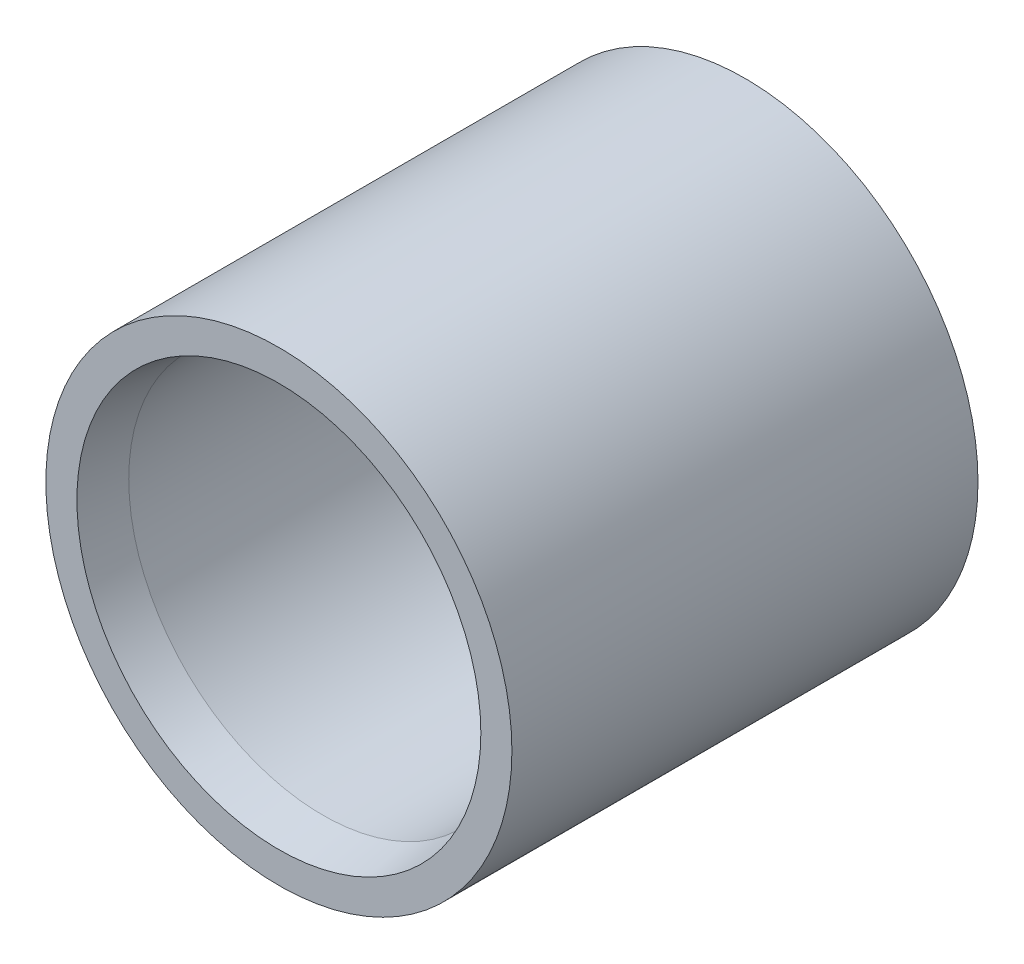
ISO-10303-21;
HEADER;
FILE_DESCRIPTION(('STEP AP214'),'2;1');
FILE_NAME('part.step','',(''),(''),'','','');
FILE_SCHEMA(('AUTOMOTIVE_DESIGN { 1 0 10303 214 1 1 1 1 }'));
ENDSEC;
DATA;
#1=APPLICATION_CONTEXT('core data for automotive mechanical design processes');
#2=APPLICATION_PROTOCOL_DEFINITION('international standard','automotive_design',2000,#1);
#3=PRODUCT_CONTEXT('',#1,'mechanical');
#4=PRODUCT('Part','Part','',(#3));
#5=PRODUCT_RELATED_PRODUCT_CATEGORY('part','',(#4));
#6=PRODUCT_DEFINITION_FORMATION('','',#4);
#7=PRODUCT_DEFINITION_CONTEXT('part definition',#1,'design');
#8=PRODUCT_DEFINITION('design','',#6,#7);
#9=PRODUCT_DEFINITION_SHAPE('','',#8);
#10=(LENGTH_UNIT() NAMED_UNIT(*) SI_UNIT(.MILLI.,.METRE.));
#11=(NAMED_UNIT(*) PLANE_ANGLE_UNIT() SI_UNIT($,.RADIAN.));
#12=(NAMED_UNIT(*) SI_UNIT($,.STERADIAN.) SOLID_ANGLE_UNIT());
#13=UNCERTAINTY_MEASURE_WITH_UNIT(LENGTH_MEASURE(1.E-05),#10,'distance_accuracy_value','');
#14=(GEOMETRIC_REPRESENTATION_CONTEXT(3) GLOBAL_UNCERTAINTY_ASSIGNED_CONTEXT((#13)) GLOBAL_UNIT_ASSIGNED_CONTEXT((#10,
#11,#12)) REPRESENTATION_CONTEXT('',''));
#15=CARTESIAN_POINT('',(0.,0.,0.));
#16=DIRECTION('',(0.,0.,1.));
#17=DIRECTION('',(1.,0.,0.));
#18=AXIS2_PLACEMENT_3D('',#15,#16,#17);
#19=CARTESIAN_POINT('',(-15.,28.,-28.9705627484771));
#20=DIRECTION('',(0.,0.,1.));
#21=DIRECTION('',(1.,0.,0.));
#22=AXIS2_PLACEMENT_3D('',#19,#20,#21);
#23=CYLINDRICAL_SURFACE('',#22,6.);
#24=CARTESIAN_POINT('',(-15.,28.,-12.));
#25=DIRECTION('',(0.,0.,1.));
#26=DIRECTION('',(1.,0.,0.));
#27=AXIS2_PLACEMENT_3D('',#24,#25,#26);
#28=CIRCLE('',#27,6.);
#29=CARTESIAN_POINT('',(-9.,28.,-12.));
#30=VERTEX_POINT('',#29);
#31=EDGE_CURVE('E48',#30,#30,#28,.F.);
#32=ORIENTED_EDGE('',*,*,#31,.F.);
#33=EDGE_LOOP('',(#32));
#34=FACE_BOUND('',#33,.T.);
#35=CARTESIAN_POINT('',(-15.,28.,0.));
#36=DIRECTION('',(0.,0.,1.));
#37=DIRECTION('',(1.,0.,0.));
#38=AXIS2_PLACEMENT_3D('',#35,#36,#37);
#39=CIRCLE('',#38,6.);
#40=CARTESIAN_POINT('',(-9.,28.,0.));
#41=VERTEX_POINT('',#40);
#42=EDGE_CURVE('E49',#41,#41,#39,.T.);
#43=ORIENTED_EDGE('',*,*,#42,.F.);
#44=EDGE_LOOP('',(#43));
#45=FACE_BOUND('',#44,.T.);
#46=ADVANCED_FACE('F29',(#34,#45),#23,.T.);
#47=CARTESIAN_POINT('',(-15.,28.,0.));
#48=DIRECTION('',(0.,0.,1.));
#49=DIRECTION('',(1.,0.,0.));
#50=AXIS2_PLACEMENT_3D('',#47,#48,#49);
#51=PLANE('',#50);
#52=CARTESIAN_POINT('',(-15.,28.,0.));
#53=DIRECTION('',(0.,0.,1.));
#54=DIRECTION('',(1.,0.,0.));
#55=AXIS2_PLACEMENT_3D('',#52,#53,#54);
#56=CIRCLE('',#55,5.19999999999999);
#57=CARTESIAN_POINT('',(-9.80000000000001,28.,0.));
#58=VERTEX_POINT('',#57);
#59=EDGE_CURVE('E35',#58,#58,#56,.F.);
#60=ORIENTED_EDGE('',*,*,#59,.T.);
#61=EDGE_LOOP('',(#60));
#62=FACE_BOUND('',#61,.T.);
#63=ORIENTED_EDGE('',*,*,#42,.T.);
#64=EDGE_LOOP('',(#63));
#65=FACE_BOUND('',#64,.T.);
#66=ADVANCED_FACE('F59',(#62,#65),#51,.T.);
#67=CARTESIAN_POINT('',(-15.,28.,-28.9705627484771));
#68=DIRECTION('',(0.,0.,1.));
#69=DIRECTION('',(1.,0.,0.));
#70=AXIS2_PLACEMENT_3D('',#67,#68,#69);
#71=CYLINDRICAL_SURFACE('',#70,5.);
#72=CARTESIAN_POINT('',(-15.,28.,-1.13425636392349));
#73=DIRECTION('',(0.,0.,1.));
#74=DIRECTION('',(1.,0.,0.));
#75=AXIS2_PLACEMENT_3D('',#72,#73,#74);
#76=CIRCLE('',#75,5.);
#77=CARTESIAN_POINT('',(-10.,28.,-1.13425636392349));
#78=VERTEX_POINT('',#77);
#79=EDGE_CURVE('E39',#78,#78,#76,.T.);
#80=ORIENTED_EDGE('',*,*,#79,.T.);
#81=EDGE_LOOP('',(#80));
#82=FACE_BOUND('',#81,.T.);
#83=CARTESIAN_POINT('',(-15.,28.,-10.8657436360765));
#84=DIRECTION('',(0.,0.,1.));
#85=DIRECTION('',(1.,0.,0.));
#86=AXIS2_PLACEMENT_3D('',#83,#84,#85);
#87=CIRCLE('',#86,5.);
#88=CARTESIAN_POINT('',(-10.,28.,-10.8657436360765));
#89=VERTEX_POINT('',#88);
#90=EDGE_CURVE('E43',#89,#89,#87,.F.);
#91=ORIENTED_EDGE('',*,*,#90,.T.);
#92=EDGE_LOOP('',(#91));
#93=FACE_BOUND('',#92,.T.);
#94=ADVANCED_FACE('F63',(#82,#93),#71,.F.);
#95=CARTESIAN_POINT('',(-7.,13.,-12.));
#96=DIRECTION('',(0.,0.,1.));
#97=DIRECTION('',(1.,0.,0.));
#98=AXIS2_PLACEMENT_3D('',#95,#96,#97);
#99=PLANE('',#98);
#100=CARTESIAN_POINT('',(-15.,28.,-12.));
#101=DIRECTION('',(0.,0.,1.));
#102=DIRECTION('',(1.,0.,0.));
#103=AXIS2_PLACEMENT_3D('',#100,#101,#102);
#104=CIRCLE('',#103,5.2);
#105=CARTESIAN_POINT('',(-9.8,28.,-12.));
#106=VERTEX_POINT('',#105);
#107=EDGE_CURVE('E10',#106,#106,#104,.T.);
#108=ORIENTED_EDGE('',*,*,#107,.T.);
#109=EDGE_LOOP('',(#108));
#110=FACE_BOUND('',#109,.T.);
#111=ORIENTED_EDGE('',*,*,#31,.T.);
#112=EDGE_LOOP('',(#111));
#113=FACE_BOUND('',#112,.T.);
#114=ADVANCED_FACE('F55',(#110,#113),#99,.F.);
#115=CARTESIAN_POINT('',(-15.,28.,-1.13425636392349));
#116=DIRECTION('',(0.,0.,1.));
#117=DIRECTION('',(1.,0.,0.));
#118=AXIS2_PLACEMENT_3D('',#115,#116,#117);
#119=CONICAL_SURFACE('',#118,5.,0.174532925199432);
#120=ORIENTED_EDGE('',*,*,#59,.F.);
#121=EDGE_LOOP('',(#120));
#122=FACE_BOUND('',#121,.T.);
#123=ORIENTED_EDGE('',*,*,#79,.F.);
#124=EDGE_LOOP('',(#123));
#125=FACE_BOUND('',#124,.T.);
#126=ADVANCED_FACE('F72',(#122,#125),#119,.F.);
#127=CARTESIAN_POINT('',(-15.,28.,-10.8657436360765));
#128=DIRECTION('',(0.,0.,-1.));
#129=DIRECTION('',(-1.,0.,0.));
#130=AXIS2_PLACEMENT_3D('',#127,#128,#129);
#131=CONICAL_SURFACE('',#130,5.,0.174532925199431);
#132=ORIENTED_EDGE('',*,*,#107,.F.);
#133=EDGE_LOOP('',(#132));
#134=FACE_BOUND('',#133,.T.);
#135=ORIENTED_EDGE('',*,*,#90,.F.);
#136=EDGE_LOOP('',(#135));
#137=FACE_BOUND('',#136,.T.);
#138=ADVANCED_FACE('F75',(#134,#137),#131,.F.);
#139=CLOSED_SHELL('',(#46,#66,#94,#114,#126,#138));
#140=MANIFOLD_SOLID_BREP('B2',#139);
#141=ADVANCED_BREP_SHAPE_REPRESENTATION('',(#18,#140),#14);
#142=SHAPE_DEFINITION_REPRESENTATION(#9,#141);
ENDSEC;
END-ISO-10303-21;
